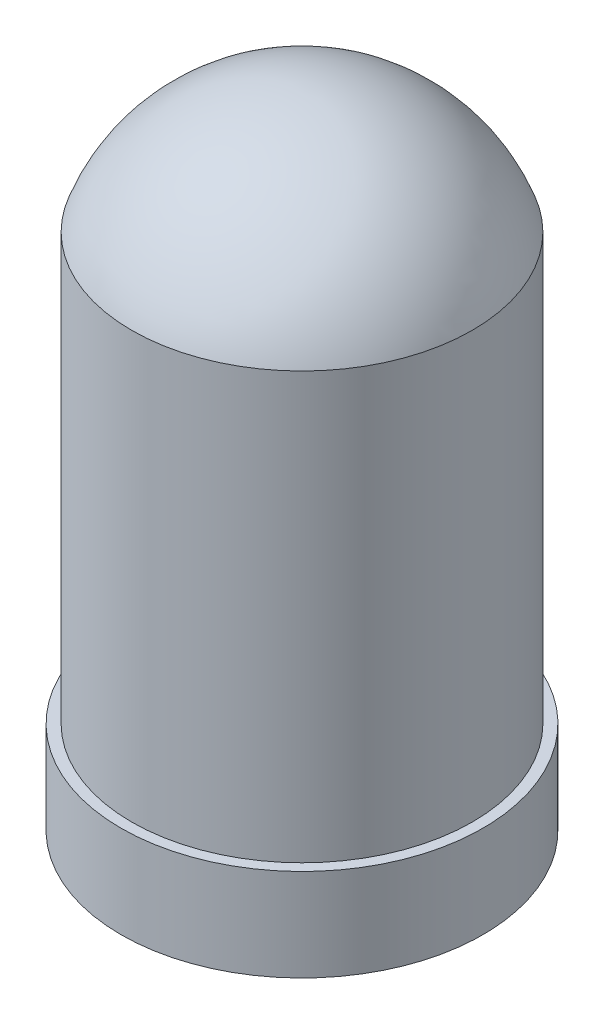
from build123d import *


with BuildPart() as part:
    # Sketch1 → Revolve1 (revolve)
    with BuildSketch(Plane.XY, mode=Mode.PRIVATE) as revolve1_sk:
        with BuildLine():
            Line((0, 9), (0, 0))
            Line((0, 0), (2.55, 0))
            Line((2.55, 0), (2.55, 1.3))
            Line((2.55, 1.3), (2.4, 1.3))
            Line((2.4, 1.3), (2.4, 7.3))
            ThreePointArc((2.4, 7.3), (1.470544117, 8.531944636), (0, 9))
        make_face()
    revolve(revolve1_sk.sketch.rotate(Axis((0, 0, 0), (0, 1, 0)), 90), axis=Axis((0, 0, 0), (0, 1, 0)))


solid = part.part
